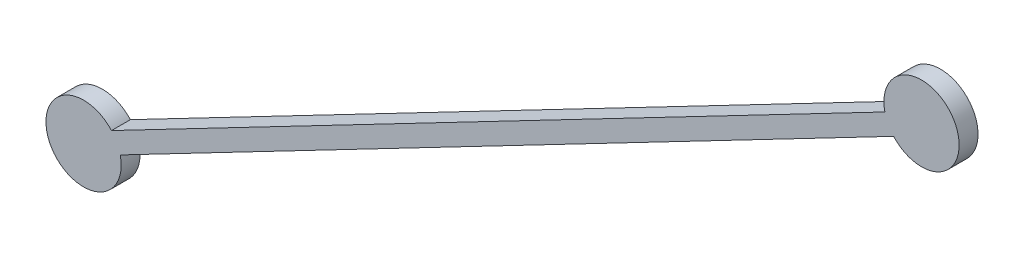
ISO-10303-21;
HEADER;
FILE_DESCRIPTION(('STEP AP214'),'2;1');
FILE_NAME('part.step','',(''),(''),'','','');
FILE_SCHEMA(('AUTOMOTIVE_DESIGN { 1 0 10303 214 1 1 1 1 }'));
ENDSEC;
DATA;
#1=APPLICATION_CONTEXT('core data for automotive mechanical design processes');
#2=APPLICATION_PROTOCOL_DEFINITION('international standard','automotive_design',2000,#1);
#3=PRODUCT_CONTEXT('',#1,'mechanical');
#4=PRODUCT('Part','Part','',(#3));
#5=PRODUCT_RELATED_PRODUCT_CATEGORY('part','',(#4));
#6=PRODUCT_DEFINITION_FORMATION('','',#4);
#7=PRODUCT_DEFINITION_CONTEXT('part definition',#1,'design');
#8=PRODUCT_DEFINITION('design','',#6,#7);
#9=PRODUCT_DEFINITION_SHAPE('','',#8);
#10=(LENGTH_UNIT() NAMED_UNIT(*) SI_UNIT(.MILLI.,.METRE.));
#11=(NAMED_UNIT(*) PLANE_ANGLE_UNIT() SI_UNIT($,.RADIAN.));
#12=(NAMED_UNIT(*) SI_UNIT($,.STERADIAN.) SOLID_ANGLE_UNIT());
#13=UNCERTAINTY_MEASURE_WITH_UNIT(LENGTH_MEASURE(1.E-05),#10,'distance_accuracy_value','');
#14=(GEOMETRIC_REPRESENTATION_CONTEXT(3) GLOBAL_UNCERTAINTY_ASSIGNED_CONTEXT((#13)) GLOBAL_UNIT_ASSIGNED_CONTEXT((#10,
#11,#12)) REPRESENTATION_CONTEXT('',''));
#15=CARTESIAN_POINT('',(0.,0.,0.));
#16=DIRECTION('',(0.,0.,1.));
#17=DIRECTION('',(1.,0.,0.));
#18=AXIS2_PLACEMENT_3D('',#15,#16,#17);
#19=CARTESIAN_POINT('',(367.404484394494,297.464615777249,-1.5));
#20=DIRECTION('',(0.,0.,1.));
#21=DIRECTION('',(1.,0.,0.));
#22=AXIS2_PLACEMENT_3D('',#19,#20,#21);
#23=CYLINDRICAL_SURFACE('',#22,1.9908260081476);
#24=CARTESIAN_POINT('',(367.404484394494,297.464615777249,-0.5));
#25=DIRECTION('',(0.,0.,1.));
#26=DIRECTION('',(1.,0.,0.));
#27=AXIS2_PLACEMENT_3D('',#24,#25,#26);
#28=CIRCLE('',#27,1.9908260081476);
#29=CARTESIAN_POINT('',(368.882631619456,298.798208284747,-0.5));
#30=VERTEX_POINT('',#29);
#31=CARTESIAN_POINT('',(369.344554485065,297.911288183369,-0.5));
#32=VERTEX_POINT('',#31);
#33=EDGE_CURVE('E72',#30,#32,#28,.T.);
#34=ORIENTED_EDGE('',*,*,#33,.F.);
#35=DIRECTION('',(0.,0.,1.));
#36=VECTOR('',#35,1.);
#37=CARTESIAN_POINT('',(368.882631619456,298.798208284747,-1.5));
#38=LINE('',#37,#36);
#39=CARTESIAN_POINT('',(368.882631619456,298.798208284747,-1.5));
#40=VERTEX_POINT('',#39);
#41=EDGE_CURVE('E11',#40,#30,#38,.T.);
#42=ORIENTED_EDGE('',*,*,#41,.F.);
#43=CARTESIAN_POINT('',(367.404484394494,297.464615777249,-1.5));
#44=DIRECTION('',(0.,0.,1.));
#45=DIRECTION('',(1.,0.,0.));
#46=AXIS2_PLACEMENT_3D('',#43,#44,#45);
#47=CIRCLE('',#46,1.9908260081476);
#48=CARTESIAN_POINT('',(369.344554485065,297.911288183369,-1.5));
#49=VERTEX_POINT('',#48);
#50=EDGE_CURVE('E74',#40,#49,#47,.T.);
#51=ORIENTED_EDGE('',*,*,#50,.T.);
#52=DIRECTION('',(0.,0.,1.));
#53=VECTOR('',#52,1.);
#54=CARTESIAN_POINT('',(369.344554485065,297.911288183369,-1.5));
#55=LINE('',#54,#53);
#56=EDGE_CURVE('E35',#49,#32,#55,.T.);
#57=ORIENTED_EDGE('',*,*,#56,.T.);
#58=EDGE_LOOP('',(#34,#42,#51,#57));
#59=FACE_BOUND('',#58,.T.);
#60=ADVANCED_FACE('F32',(#59),#23,.T.);
#61=CARTESIAN_POINT('',(368.882631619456,298.798208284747,-1.5));
#62=DIRECTION('',(-0.461922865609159,0.886920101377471,0.));
#63=DIRECTION('',(-0.886920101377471,-0.461922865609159,0.));
#64=AXIS2_PLACEMENT_3D('',#61,#62,#63);
#65=PLANE('',#64);
#66=DIRECTION('',(-0.886920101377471,-0.461922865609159,0.));
#67=VECTOR('',#66,1.);
#68=CARTESIAN_POINT('',(368.882631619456,298.798208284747,-0.5));
#69=LINE('',#68,#67);
#70=CARTESIAN_POINT('',(409.810419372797,320.114086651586,-0.5));
#71=VERTEX_POINT('',#70);
#72=EDGE_CURVE('E89',#71,#30,#69,.T.);
#73=ORIENTED_EDGE('',*,*,#72,.F.);
#74=DIRECTION('',(0.,0.,1.));
#75=VECTOR('',#74,1.);
#76=CARTESIAN_POINT('',(409.810419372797,320.114086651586,-1.5));
#77=LINE('',#76,#75);
#78=CARTESIAN_POINT('',(409.810419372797,320.114086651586,-1.5));
#79=VERTEX_POINT('',#78);
#80=EDGE_CURVE('E40',#79,#71,#77,.T.);
#81=ORIENTED_EDGE('',*,*,#80,.F.);
#82=DIRECTION('',(-0.886920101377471,-0.461922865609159,0.));
#83=VECTOR('',#82,1.);
#84=CARTESIAN_POINT('',(368.882631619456,298.798208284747,-1.5));
#85=LINE('',#84,#83);
#86=EDGE_CURVE('E79',#79,#40,#85,.T.);
#87=ORIENTED_EDGE('',*,*,#86,.T.);
#88=ORIENTED_EDGE('',*,*,#41,.T.);
#89=EDGE_LOOP('',(#73,#81,#87,#88));
#90=FACE_BOUND('',#89,.T.);
#91=ADVANCED_FACE('F104',(#90),#65,.T.);
#92=CARTESIAN_POINT('',(411.750489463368,320.560759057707,-1.5));
#93=DIRECTION('',(0.,0.,1.));
#94=DIRECTION('',(1.,0.,0.));
#95=AXIS2_PLACEMENT_3D('',#92,#93,#94);
#96=CYLINDRICAL_SURFACE('',#95,1.9908260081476);
#97=CARTESIAN_POINT('',(411.750489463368,320.560759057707,-0.5));
#98=DIRECTION('',(0.,0.,1.));
#99=DIRECTION('',(1.,0.,0.));
#100=AXIS2_PLACEMENT_3D('',#97,#98,#99);
#101=CIRCLE('',#100,1.9908260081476);
#102=CARTESIAN_POINT('',(410.272342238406,319.227166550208,-0.5));
#103=VERTEX_POINT('',#102);
#104=EDGE_CURVE('E86',#103,#71,#101,.T.);
#105=ORIENTED_EDGE('',*,*,#104,.F.);
#106=DIRECTION('',(0.,0.,1.));
#107=VECTOR('',#106,1.);
#108=CARTESIAN_POINT('',(410.272342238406,319.227166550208,-1.5));
#109=LINE('',#108,#107);
#110=CARTESIAN_POINT('',(410.272342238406,319.227166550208,-1.5));
#111=VERTEX_POINT('',#110);
#112=EDGE_CURVE('E78',#111,#103,#109,.T.);
#113=ORIENTED_EDGE('',*,*,#112,.F.);
#114=CARTESIAN_POINT('',(411.750489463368,320.560759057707,-1.5));
#115=DIRECTION('',(0.,0.,1.));
#116=DIRECTION('',(1.,0.,0.));
#117=AXIS2_PLACEMENT_3D('',#114,#115,#116);
#118=CIRCLE('',#117,1.9908260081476);
#119=EDGE_CURVE('E97',#111,#79,#118,.T.);
#120=ORIENTED_EDGE('',*,*,#119,.T.);
#121=ORIENTED_EDGE('',*,*,#80,.T.);
#122=EDGE_LOOP('',(#105,#113,#120,#121));
#123=FACE_BOUND('',#122,.T.);
#124=ADVANCED_FACE('F101',(#123),#96,.T.);
#125=CARTESIAN_POINT('',(369.344554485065,297.911288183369,-1.5));
#126=DIRECTION('',(0.461922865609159,-0.886920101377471,0.));
#127=DIRECTION('',(0.886920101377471,0.461922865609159,0.));
#128=AXIS2_PLACEMENT_3D('',#125,#126,#127);
#129=PLANE('',#128);
#130=DIRECTION('',(0.886920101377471,0.461922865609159,0.));
#131=VECTOR('',#130,1.);
#132=CARTESIAN_POINT('',(369.344554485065,297.911288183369,-0.5));
#133=LINE('',#132,#131);
#134=EDGE_CURVE('E81',#32,#103,#133,.T.);
#135=ORIENTED_EDGE('',*,*,#134,.F.);
#136=ORIENTED_EDGE('',*,*,#56,.F.);
#137=DIRECTION('',(0.886920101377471,0.461922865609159,0.));
#138=VECTOR('',#137,1.);
#139=CARTESIAN_POINT('',(369.344554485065,297.911288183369,-1.5));
#140=LINE('',#139,#138);
#141=EDGE_CURVE('E95',#49,#111,#140,.T.);
#142=ORIENTED_EDGE('',*,*,#141,.T.);
#143=ORIENTED_EDGE('',*,*,#112,.T.);
#144=EDGE_LOOP('',(#135,#136,#142,#143));
#145=FACE_BOUND('',#144,.T.);
#146=ADVANCED_FACE('F82',(#145),#129,.T.);
#147=CARTESIAN_POINT('',(367.404484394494,297.464615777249,-1.5));
#148=DIRECTION('',(0.,0.,1.));
#149=DIRECTION('',(1.,0.,0.));
#150=AXIS2_PLACEMENT_3D('',#147,#148,#149);
#151=PLANE('',#150);
#152=ORIENTED_EDGE('',*,*,#50,.F.);
#153=ORIENTED_EDGE('',*,*,#86,.F.);
#154=ORIENTED_EDGE('',*,*,#119,.F.);
#155=ORIENTED_EDGE('',*,*,#141,.F.);
#156=EDGE_LOOP('',(#152,#153,#154,#155));
#157=FACE_BOUND('',#156,.T.);
#158=ADVANCED_FACE('F106',(#157),#151,.F.);
#159=CARTESIAN_POINT('',(367.404484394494,297.464615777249,-0.5));
#160=DIRECTION('',(0.,0.,1.));
#161=DIRECTION('',(1.,0.,0.));
#162=AXIS2_PLACEMENT_3D('',#159,#160,#161);
#163=PLANE('',#162);
#164=ORIENTED_EDGE('',*,*,#33,.T.);
#165=ORIENTED_EDGE('',*,*,#134,.T.);
#166=ORIENTED_EDGE('',*,*,#104,.T.);
#167=ORIENTED_EDGE('',*,*,#72,.T.);
#168=EDGE_LOOP('',(#164,#165,#166,#167));
#169=FACE_BOUND('',#168,.T.);
#170=ADVANCED_FACE('F88',(#169),#163,.T.);
#171=CLOSED_SHELL('',(#60,#91,#124,#146,#158,#170));
#172=MANIFOLD_SOLID_BREP('B2',#171);
#173=ADVANCED_BREP_SHAPE_REPRESENTATION('',(#18,#172),#14);
#174=SHAPE_DEFINITION_REPRESENTATION(#9,#173);
ENDSEC;
END-ISO-10303-21;
